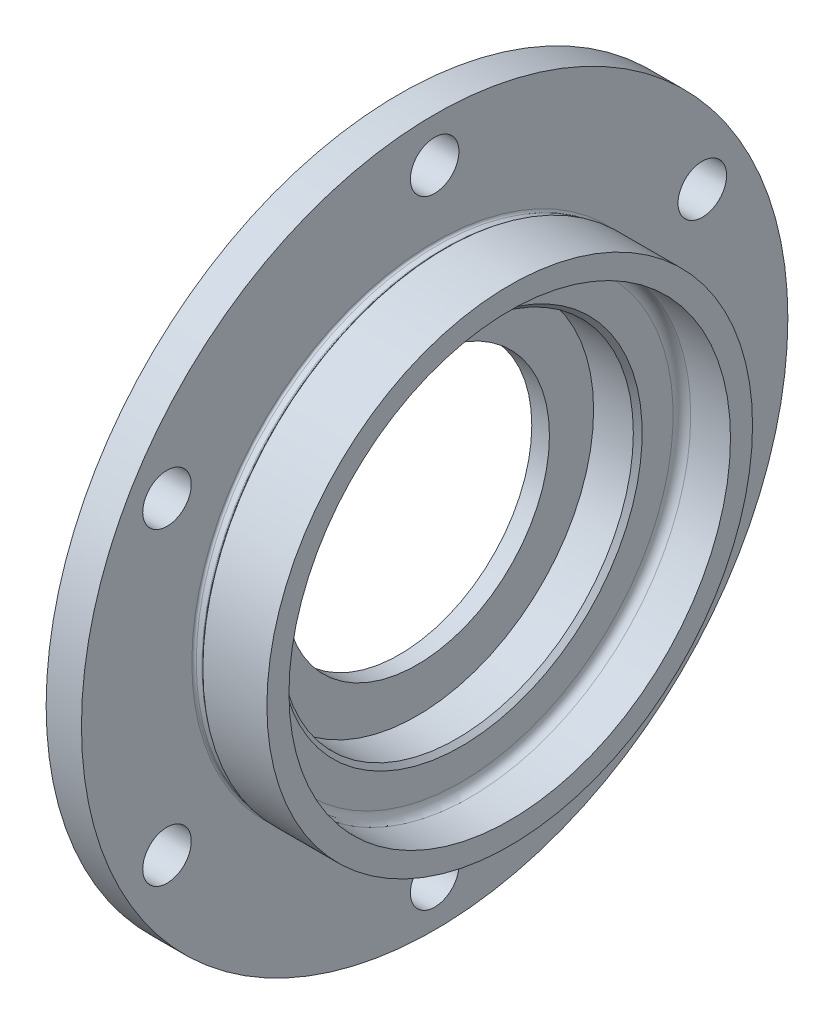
ISO-10303-21;
HEADER;
FILE_DESCRIPTION(('STEP AP214'),'2;1');
FILE_NAME('part.step','',(''),(''),'','','');
FILE_SCHEMA(('AUTOMOTIVE_DESIGN { 1 0 10303 214 1 1 1 1 }'));
ENDSEC;
DATA;
#1=APPLICATION_CONTEXT('core data for automotive mechanical design processes');
#2=APPLICATION_PROTOCOL_DEFINITION('international standard','automotive_design',2000,#1);
#3=PRODUCT_CONTEXT('',#1,'mechanical');
#4=PRODUCT('Part','Part','',(#3));
#5=PRODUCT_RELATED_PRODUCT_CATEGORY('part','',(#4));
#6=PRODUCT_DEFINITION_FORMATION('','',#4);
#7=PRODUCT_DEFINITION_CONTEXT('part definition',#1,'design');
#8=PRODUCT_DEFINITION('design','',#6,#7);
#9=PRODUCT_DEFINITION_SHAPE('','',#8);
#10=(LENGTH_UNIT() NAMED_UNIT(*) SI_UNIT(.MILLI.,.METRE.));
#11=(NAMED_UNIT(*) PLANE_ANGLE_UNIT() SI_UNIT($,.RADIAN.));
#12=(NAMED_UNIT(*) SI_UNIT($,.STERADIAN.) SOLID_ANGLE_UNIT());
#13=UNCERTAINTY_MEASURE_WITH_UNIT(LENGTH_MEASURE(1.E-05),#10,'distance_accuracy_value','');
#14=(GEOMETRIC_REPRESENTATION_CONTEXT(3) GLOBAL_UNCERTAINTY_ASSIGNED_CONTEXT((#13)) GLOBAL_UNIT_ASSIGNED_CONTEXT((#10,
#11,#12)) REPRESENTATION_CONTEXT('',''));
#15=CARTESIAN_POINT('',(0.,0.,0.));
#16=DIRECTION('',(0.,0.,1.));
#17=DIRECTION('',(1.,0.,0.));
#18=AXIS2_PLACEMENT_3D('',#15,#16,#17);
#19=CARTESIAN_POINT('',(4.,-25.3344041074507,0.));
#20=DIRECTION('',(-1.,0.,0.));
#21=DIRECTION('',(0.,0.,1.));
#22=AXIS2_PLACEMENT_3D('',#19,#20,#21);
#23=PLANE('',#22);
#24=CARTESIAN_POINT('',(4.,0.,0.));
#25=DIRECTION('',(-1.,0.,0.));
#26=DIRECTION('',(0.,0.,1.));
#27=AXIS2_PLACEMENT_3D('',#24,#25,#26);
#28=CIRCLE('',#27,30.);
#29=CARTESIAN_POINT('',(4.,0.,30.));
#30=VERTEX_POINT('',#29);
#31=EDGE_CURVE('E116',#30,#30,#28,.F.);
#32=ORIENTED_EDGE('',*,*,#31,.F.);
#33=EDGE_LOOP('',(#32));
#34=FACE_BOUND('',#33,.T.);
#35=CARTESIAN_POINT('',(4.,0.,0.));
#36=DIRECTION('',(1.,0.,0.));
#37=DIRECTION('',(0.,0.,-1.));
#38=AXIS2_PLACEMENT_3D('',#35,#36,#37);
#39=CIRCLE('',#38,40.);
#40=CARTESIAN_POINT('',(4.,0.,-40.));
#41=VERTEX_POINT('',#40);
#42=EDGE_CURVE('E62',#41,#41,#39,.T.);
#43=ORIENTED_EDGE('',*,*,#42,.T.);
#44=EDGE_LOOP('',(#43));
#45=FACE_BOUND('',#44,.T.);
#46=ADVANCED_FACE('F30',(#34,#45),#23,.F.);
#47=CARTESIAN_POINT('',(29.9069920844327,0.,0.));
#48=DIRECTION('',(1.,0.,0.));
#49=DIRECTION('',(0.,0.,-1.));
#50=AXIS2_PLACEMENT_3D('',#47,#48,#49);
#51=CYLINDRICAL_SURFACE('',#50,40.);
#52=CARTESIAN_POINT('',(13.,0.,0.));
#53=DIRECTION('',(-1.,0.,0.));
#54=DIRECTION('',(0.,0.,1.));
#55=AXIS2_PLACEMENT_3D('',#52,#53,#54);
#56=CIRCLE('',#55,40.);
#57=CARTESIAN_POINT('',(13.,0.,40.));
#58=VERTEX_POINT('',#57);
#59=EDGE_CURVE('E45',#58,#58,#56,.F.);
#60=ORIENTED_EDGE('',*,*,#59,.T.);
#61=EDGE_LOOP('',(#60));
#62=FACE_BOUND('',#61,.T.);
#63=ORIENTED_EDGE('',*,*,#42,.F.);
#64=EDGE_LOOP('',(#63));
#65=FACE_BOUND('',#64,.T.);
#66=ADVANCED_FACE('F158',(#62,#65),#51,.F.);
#67=CARTESIAN_POINT('',(14.,-25.3344041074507,0.));
#68=DIRECTION('',(-1.,0.,0.));
#69=DIRECTION('',(0.,0.,1.));
#70=AXIS2_PLACEMENT_3D('',#67,#68,#69);
#71=PLANE('',#70);
#72=CARTESIAN_POINT('',(14.,0.,0.));
#73=DIRECTION('',(-1.,0.,0.));
#74=DIRECTION('',(0.,0.,1.));
#75=AXIS2_PLACEMENT_3D('',#72,#73,#74);
#76=CIRCLE('',#75,48.);
#77=CARTESIAN_POINT('',(14.,0.,48.));
#78=VERTEX_POINT('',#77);
#79=EDGE_CURVE('E37',#78,#78,#76,.F.);
#80=ORIENTED_EDGE('',*,*,#79,.T.);
#81=EDGE_LOOP('',(#80));
#82=FACE_BOUND('',#81,.T.);
#83=CARTESIAN_POINT('',(14.,0.,0.));
#84=DIRECTION('',(-1.,0.,0.));
#85=DIRECTION('',(0.,0.,1.));
#86=AXIS2_PLACEMENT_3D('',#83,#84,#85);
#87=CIRCLE('',#86,41.);
#88=CARTESIAN_POINT('',(14.,0.,41.));
#89=VERTEX_POINT('',#88);
#90=EDGE_CURVE('E41',#89,#89,#87,.T.);
#91=ORIENTED_EDGE('',*,*,#90,.T.);
#92=EDGE_LOOP('',(#91));
#93=FACE_BOUND('',#92,.T.);
#94=ADVANCED_FACE('F164',(#82,#93),#71,.F.);
#95=CARTESIAN_POINT('',(29.9069920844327,0.,0.));
#96=DIRECTION('',(1.,0.,0.));
#97=DIRECTION('',(0.,0.,-1.));
#98=AXIS2_PLACEMENT_3D('',#95,#96,#97);
#99=CYLINDRICAL_SURFACE('',#98,50.);
#100=CARTESIAN_POINT('',(16.,0.,0.));
#101=DIRECTION('',(-1.,0.,0.));
#102=DIRECTION('',(0.,0.,1.));
#103=AXIS2_PLACEMENT_3D('',#100,#101,#102);
#104=CIRCLE('',#103,50.);
#105=CARTESIAN_POINT('',(16.,0.,50.));
#106=VERTEX_POINT('',#105);
#107=EDGE_CURVE('E10',#106,#106,#104,.T.);
#108=ORIENTED_EDGE('',*,*,#107,.T.);
#109=EDGE_LOOP('',(#108));
#110=FACE_BOUND('',#109,.T.);
#111=CARTESIAN_POINT('',(25.,0.,0.));
#112=DIRECTION('',(1.,0.,0.));
#113=DIRECTION('',(0.,0.,-1.));
#114=AXIS2_PLACEMENT_3D('',#111,#112,#113);
#115=CIRCLE('',#114,50.);
#116=CARTESIAN_POINT('',(25.,0.,-50.));
#117=VERTEX_POINT('',#116);
#118=EDGE_CURVE('E65',#117,#117,#115,.T.);
#119=ORIENTED_EDGE('',*,*,#118,.T.);
#120=EDGE_LOOP('',(#119));
#121=FACE_BOUND('',#120,.T.);
#122=ADVANCED_FACE('F195',(#110,#121),#99,.F.);
#123=CARTESIAN_POINT('',(25.,-25.3344041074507,0.));
#124=DIRECTION('',(-1.,0.,0.));
#125=DIRECTION('',(0.,0.,1.));
#126=AXIS2_PLACEMENT_3D('',#123,#124,#125);
#127=PLANE('',#126);
#128=ORIENTED_EDGE('',*,*,#118,.F.);
#129=EDGE_LOOP('',(#128));
#130=FACE_BOUND('',#129,.T.);
#131=CARTESIAN_POINT('',(25.,0.,0.));
#132=DIRECTION('',(1.,0.,0.));
#133=DIRECTION('',(0.,0.,-1.));
#134=AXIS2_PLACEMENT_3D('',#131,#132,#133);
#135=CIRCLE('',#134,55.);
#136=CARTESIAN_POINT('',(25.,0.,-55.));
#137=VERTEX_POINT('',#136);
#138=EDGE_CURVE('E68',#137,#137,#135,.T.);
#139=ORIENTED_EDGE('',*,*,#138,.T.);
#140=EDGE_LOOP('',(#139));
#141=FACE_BOUND('',#140,.T.);
#142=ADVANCED_FACE('F199',(#130,#141),#127,.F.);
#143=CARTESIAN_POINT('',(29.9069920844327,0.,0.));
#144=DIRECTION('',(1.,0.,0.));
#145=DIRECTION('',(0.,0.,-1.));
#146=AXIS2_PLACEMENT_3D('',#143,#144,#145);
#147=CYLINDRICAL_SURFACE('',#146,55.);
#148=CARTESIAN_POINT('',(10.5,0.,0.));
#149=DIRECTION('',(1.,0.,0.));
#150=DIRECTION('',(0.,0.,-1.));
#151=AXIS2_PLACEMENT_3D('',#148,#149,#150);
#152=CIRCLE('',#151,55.);
#153=CARTESIAN_POINT('',(10.5,0.,-55.));
#154=VERTEX_POINT('',#153);
#155=EDGE_CURVE('E77',#154,#154,#152,.T.);
#156=ORIENTED_EDGE('',*,*,#155,.T.);
#157=EDGE_LOOP('',(#156));
#158=FACE_BOUND('',#157,.T.);
#159=ORIENTED_EDGE('',*,*,#138,.F.);
#160=EDGE_LOOP('',(#159));
#161=FACE_BOUND('',#160,.T.);
#162=ADVANCED_FACE('F204',(#158,#161),#147,.T.);
#163=CARTESIAN_POINT('',(36.050630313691,0.,0.));
#164=DIRECTION('',(1.,0.,0.));
#165=DIRECTION('',(0.,0.,-1.));
#166=AXIS2_PLACEMENT_3D('',#163,#164,#165);
#167=CYLINDRICAL_SURFACE('',#166,54.5);
#168=CARTESIAN_POINT('',(8.5,0.,0.));
#169=DIRECTION('',(-1.,0.,0.));
#170=DIRECTION('',(0.,0.,1.));
#171=AXIS2_PLACEMENT_3D('',#168,#169,#170);
#172=CIRCLE('',#171,54.5);
#173=CARTESIAN_POINT('',(8.5,0.,54.5));
#174=VERTEX_POINT('',#173);
#175=EDGE_CURVE('E56',#174,#174,#172,.F.);
#176=ORIENTED_EDGE('',*,*,#175,.T.);
#177=EDGE_LOOP('',(#176));
#178=FACE_BOUND('',#177,.T.);
#179=CARTESIAN_POINT('',(9.79289321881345,0.,0.));
#180=DIRECTION('',(1.,0.,0.));
#181=DIRECTION('',(0.,0.,-1.));
#182=AXIS2_PLACEMENT_3D('',#179,#180,#181);
#183=CIRCLE('',#182,54.5);
#184=CARTESIAN_POINT('',(9.79289321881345,0.,-54.5));
#185=VERTEX_POINT('',#184);
#186=EDGE_CURVE('E59',#185,#185,#183,.F.);
#187=ORIENTED_EDGE('',*,*,#186,.T.);
#188=EDGE_LOOP('',(#187));
#189=FACE_BOUND('',#188,.T.);
#190=ADVANCED_FACE('F207',(#178,#189),#167,.T.);
#191=CARTESIAN_POINT('',(10.,0.,0.));
#192=DIRECTION('',(1.,0.,0.));
#193=DIRECTION('',(0.,0.,-1.));
#194=AXIS2_PLACEMENT_3D('',#191,#192,#193);
#195=CONICAL_SURFACE('',#194,54.5,0.785398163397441);
#196=CARTESIAN_POINT('',(10.1464466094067,0.,0.));
#197=DIRECTION('',(1.,0.,0.));
#198=DIRECTION('',(0.,0.,-1.));
#199=AXIS2_PLACEMENT_3D('',#196,#197,#198);
#200=CIRCLE('',#199,54.6464466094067);
#201=CARTESIAN_POINT('',(10.1464466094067,0.,-54.6464466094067));
#202=VERTEX_POINT('',#201);
#203=EDGE_CURVE('E50',#202,#202,#200,.T.);
#204=ORIENTED_EDGE('',*,*,#203,.T.);
#205=EDGE_LOOP('',(#204));
#206=FACE_BOUND('',#205,.T.);
#207=ORIENTED_EDGE('',*,*,#155,.F.);
#208=EDGE_LOOP('',(#207));
#209=FACE_BOUND('',#208,.T.);
#210=ADVANCED_FACE('F130',(#206,#209),#195,.T.);
#211=CARTESIAN_POINT('',(0.,-25.3344041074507,0.));
#212=DIRECTION('',(1.,0.,0.));
#213=DIRECTION('',(0.,0.,-1.));
#214=AXIS2_PLACEMENT_3D('',#211,#212,#213);
#215=PLANE('',#214);
#216=CARTESIAN_POINT('',(0.,0.,0.));
#217=DIRECTION('',(-1.,0.,0.));
#218=DIRECTION('',(0.,0.,1.));
#219=AXIS2_PLACEMENT_3D('',#216,#217,#218);
#220=CIRCLE('',#219,30.);
#221=CARTESIAN_POINT('',(0.,0.,30.));
#222=VERTEX_POINT('',#221);
#223=EDGE_CURVE('E119',#222,#222,#220,.T.);
#224=ORIENTED_EDGE('',*,*,#223,.F.);
#225=EDGE_LOOP('',(#224));
#226=FACE_BOUND('',#225,.T.);
#227=CARTESIAN_POINT('',(0.,35.0000000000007,-60.6217782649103));
#228=DIRECTION('',(-1.,0.,0.));
#229=DIRECTION('',(0.,0.866025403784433,0.50000000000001));
#230=AXIS2_PLACEMENT_3D('',#227,#228,#229);
#231=CIRCLE('',#230,5.5);
#232=CARTESIAN_POINT('',(0.,35.0000000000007,-55.1217782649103));
#233=VERTEX_POINT('',#232);
#234=EDGE_CURVE('E113',#233,#233,#231,.T.);
#235=ORIENTED_EDGE('',*,*,#234,.F.);
#236=EDGE_LOOP('',(#235));
#237=FACE_BOUND('',#236,.T.);
#238=CARTESIAN_POINT('',(0.,-34.9999999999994,-60.621778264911));
#239=DIRECTION('',(-1.,0.,0.));
#240=DIRECTION('',(0.,0.866025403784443,-0.499999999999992));
#241=AXIS2_PLACEMENT_3D('',#238,#239,#240);
#242=CIRCLE('',#241,5.5);
#243=CARTESIAN_POINT('',(0.,-34.9999999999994,-55.121778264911));
#244=VERTEX_POINT('',#243);
#245=EDGE_CURVE('E107',#244,#244,#242,.T.);
#246=ORIENTED_EDGE('',*,*,#245,.F.);
#247=EDGE_LOOP('',(#246));
#248=FACE_BOUND('',#247,.T.);
#249=CARTESIAN_POINT('',(0.,-70.,-4.88807670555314E-13));
#250=DIRECTION('',(-1.,0.,0.));
#251=DIRECTION('',(0.,0.,-1.));
#252=AXIS2_PLACEMENT_3D('',#249,#250,#251);
#253=CIRCLE('',#252,5.5);
#254=CARTESIAN_POINT('',(0.,-70.,5.49999999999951));
#255=VERTEX_POINT('',#254);
#256=EDGE_CURVE('E101',#255,#255,#253,.T.);
#257=ORIENTED_EDGE('',*,*,#256,.F.);
#258=EDGE_LOOP('',(#257));
#259=FACE_BOUND('',#258,.T.);
#260=CARTESIAN_POINT('',(0.,-35.0000000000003,60.6217782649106));
#261=DIRECTION('',(-1.,0.,0.));
#262=DIRECTION('',(0.,-0.866025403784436,-0.500000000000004));
#263=AXIS2_PLACEMENT_3D('',#260,#261,#262);
#264=CIRCLE('',#263,5.5);
#265=CARTESIAN_POINT('',(0.,-35.0000000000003,66.1217782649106));
#266=VERTEX_POINT('',#265);
#267=EDGE_CURVE('E95',#266,#266,#264,.T.);
#268=ORIENTED_EDGE('',*,*,#267,.F.);
#269=EDGE_LOOP('',(#268));
#270=FACE_BOUND('',#269,.T.);
#271=CARTESIAN_POINT('',(0.,34.9999999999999,60.6217782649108));
#272=DIRECTION('',(-1.,0.,0.));
#273=DIRECTION('',(0.,-0.86602540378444,0.499999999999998));
#274=AXIS2_PLACEMENT_3D('',#271,#272,#273);
#275=CIRCLE('',#274,5.5);
#276=CARTESIAN_POINT('',(0.,34.9999999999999,66.1217782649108));
#277=VERTEX_POINT('',#276);
#278=EDGE_CURVE('E89',#277,#277,#275,.T.);
#279=ORIENTED_EDGE('',*,*,#278,.F.);
#280=EDGE_LOOP('',(#279));
#281=FACE_BOUND('',#280,.T.);
#282=CARTESIAN_POINT('',(0.,70.,0.));
#283=DIRECTION('',(-1.,0.,0.));
#284=DIRECTION('',(0.,0.,1.));
#285=AXIS2_PLACEMENT_3D('',#282,#283,#284);
#286=CIRCLE('',#285,5.5);
#287=CARTESIAN_POINT('',(0.,70.,5.5));
#288=VERTEX_POINT('',#287);
#289=EDGE_CURVE('E83',#288,#288,#286,.T.);
#290=ORIENTED_EDGE('',*,*,#289,.F.);
#291=EDGE_LOOP('',(#290));
#292=FACE_BOUND('',#291,.T.);
#293=CARTESIAN_POINT('',(0.,0.,0.));
#294=DIRECTION('',(1.,0.,0.));
#295=DIRECTION('',(0.,0.,-1.));
#296=AXIS2_PLACEMENT_3D('',#293,#294,#295);
#297=CIRCLE('',#296,80.);
#298=CARTESIAN_POINT('',(0.,0.,-80.));
#299=VERTEX_POINT('',#298);
#300=EDGE_CURVE('E74',#299,#299,#297,.T.);
#301=ORIENTED_EDGE('',*,*,#300,.F.);
#302=EDGE_LOOP('',(#301));
#303=FACE_BOUND('',#302,.T.);
#304=ADVANCED_FACE('F126',(#226,#237,#248,#259,#270,#281,#292,#303),#215,.F.);
#305=CARTESIAN_POINT('',(29.9069920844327,0.,0.));
#306=DIRECTION('',(1.,0.,0.));
#307=DIRECTION('',(0.,0.,-1.));
#308=AXIS2_PLACEMENT_3D('',#305,#306,#307);
#309=CYLINDRICAL_SURFACE('',#308,80.);
#310=CARTESIAN_POINT('',(8.,0.,0.));
#311=DIRECTION('',(1.,0.,0.));
#312=DIRECTION('',(0.,0.,-1.));
#313=AXIS2_PLACEMENT_3D('',#310,#311,#312);
#314=CIRCLE('',#313,80.);
#315=CARTESIAN_POINT('',(8.,0.,-80.));
#316=VERTEX_POINT('',#315);
#317=EDGE_CURVE('E71',#316,#316,#314,.T.);
#318=ORIENTED_EDGE('',*,*,#317,.F.);
#319=EDGE_LOOP('',(#318));
#320=FACE_BOUND('',#319,.T.);
#321=ORIENTED_EDGE('',*,*,#300,.T.);
#322=EDGE_LOOP('',(#321));
#323=FACE_BOUND('',#322,.T.);
#324=ADVANCED_FACE('F129',(#320,#323),#309,.T.);
#325=CARTESIAN_POINT('',(8.,-25.3344041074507,0.));
#326=DIRECTION('',(-1.,0.,0.));
#327=DIRECTION('',(0.,0.,1.));
#328=AXIS2_PLACEMENT_3D('',#325,#326,#327);
#329=PLANE('',#328);
#330=CARTESIAN_POINT('',(8.,35.0000000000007,-60.6217782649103));
#331=DIRECTION('',(-1.,0.,0.));
#332=DIRECTION('',(0.,0.,1.));
#333=AXIS2_PLACEMENT_3D('',#330,#331,#332);
#334=CIRCLE('',#333,5.5);
#335=CARTESIAN_POINT('',(8.,35.0000000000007,-55.1217782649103));
#336=VERTEX_POINT('',#335);
#337=EDGE_CURVE('E110',#336,#336,#334,.F.);
#338=ORIENTED_EDGE('',*,*,#337,.F.);
#339=EDGE_LOOP('',(#338));
#340=FACE_BOUND('',#339,.T.);
#341=CARTESIAN_POINT('',(8.,-34.9999999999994,-60.621778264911));
#342=DIRECTION('',(-1.,0.,0.));
#343=DIRECTION('',(0.,0.,1.));
#344=AXIS2_PLACEMENT_3D('',#341,#342,#343);
#345=CIRCLE('',#344,5.5);
#346=CARTESIAN_POINT('',(8.,-34.9999999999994,-55.121778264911));
#347=VERTEX_POINT('',#346);
#348=EDGE_CURVE('E104',#347,#347,#345,.F.);
#349=ORIENTED_EDGE('',*,*,#348,.F.);
#350=EDGE_LOOP('',(#349));
#351=FACE_BOUND('',#350,.T.);
#352=CARTESIAN_POINT('',(8.,-70.,-4.88807670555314E-13));
#353=DIRECTION('',(-1.,0.,0.));
#354=DIRECTION('',(0.,0.,1.));
#355=AXIS2_PLACEMENT_3D('',#352,#353,#354);
#356=CIRCLE('',#355,5.5);
#357=CARTESIAN_POINT('',(8.,-70.,5.49999999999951));
#358=VERTEX_POINT('',#357);
#359=EDGE_CURVE('E98',#358,#358,#356,.F.);
#360=ORIENTED_EDGE('',*,*,#359,.F.);
#361=EDGE_LOOP('',(#360));
#362=FACE_BOUND('',#361,.T.);
#363=CARTESIAN_POINT('',(8.,-35.0000000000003,60.6217782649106));
#364=DIRECTION('',(-1.,0.,0.));
#365=DIRECTION('',(0.,0.,1.));
#366=AXIS2_PLACEMENT_3D('',#363,#364,#365);
#367=CIRCLE('',#366,5.5);
#368=CARTESIAN_POINT('',(8.,-35.0000000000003,66.1217782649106));
#369=VERTEX_POINT('',#368);
#370=EDGE_CURVE('E92',#369,#369,#367,.F.);
#371=ORIENTED_EDGE('',*,*,#370,.F.);
#372=EDGE_LOOP('',(#371));
#373=FACE_BOUND('',#372,.T.);
#374=CARTESIAN_POINT('',(8.,34.9999999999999,60.6217782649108));
#375=DIRECTION('',(-1.,0.,0.));
#376=DIRECTION('',(0.,0.,1.));
#377=AXIS2_PLACEMENT_3D('',#374,#375,#376);
#378=CIRCLE('',#377,5.5);
#379=CARTESIAN_POINT('',(8.,34.9999999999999,66.1217782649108));
#380=VERTEX_POINT('',#379);
#381=EDGE_CURVE('E86',#380,#380,#378,.F.);
#382=ORIENTED_EDGE('',*,*,#381,.F.);
#383=EDGE_LOOP('',(#382));
#384=FACE_BOUND('',#383,.T.);
#385=CARTESIAN_POINT('',(8.,70.,0.));
#386=DIRECTION('',(-1.,0.,0.));
#387=DIRECTION('',(0.,0.,1.));
#388=AXIS2_PLACEMENT_3D('',#385,#386,#387);
#389=CIRCLE('',#388,5.5);
#390=CARTESIAN_POINT('',(8.,70.,5.5));
#391=VERTEX_POINT('',#390);
#392=EDGE_CURVE('E80',#391,#391,#389,.F.);
#393=ORIENTED_EDGE('',*,*,#392,.F.);
#394=EDGE_LOOP('',(#393));
#395=FACE_BOUND('',#394,.T.);
#396=CARTESIAN_POINT('',(8.,0.,0.));
#397=DIRECTION('',(-1.,0.,0.));
#398=DIRECTION('',(0.,0.,1.));
#399=AXIS2_PLACEMENT_3D('',#396,#397,#398);
#400=CIRCLE('',#399,55.);
#401=CARTESIAN_POINT('',(8.,0.,55.));
#402=VERTEX_POINT('',#401);
#403=EDGE_CURVE('E53',#402,#402,#400,.T.);
#404=ORIENTED_EDGE('',*,*,#403,.T.);
#405=EDGE_LOOP('',(#404));
#406=FACE_BOUND('',#405,.T.);
#407=ORIENTED_EDGE('',*,*,#317,.T.);
#408=EDGE_LOOP('',(#407));
#409=FACE_BOUND('',#408,.T.);
#410=ADVANCED_FACE('F147',(#340,#351,#362,#373,#384,#395,#406,#409),#329,.F.);
#411=CARTESIAN_POINT('',(8.5,0.,0.));
#412=DIRECTION('',(-1.,0.,0.));
#413=DIRECTION('',(0.,0.,1.));
#414=AXIS2_PLACEMENT_3D('',#411,#412,#413);
#415=TOROIDAL_SURFACE('',#414,55.,0.5);
#416=ORIENTED_EDGE('',*,*,#403,.F.);
#417=EDGE_LOOP('',(#416));
#418=FACE_BOUND('',#417,.T.);
#419=ORIENTED_EDGE('',*,*,#175,.F.);
#420=EDGE_LOOP('',(#419));
#421=FACE_BOUND('',#420,.T.);
#422=ADVANCED_FACE('F153',(#418,#421),#415,.F.);
#423=CARTESIAN_POINT('',(9.79289321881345,0.,0.));
#424=DIRECTION('',(1.,0.,0.));
#425=DIRECTION('',(0.,0.,-1.));
#426=AXIS2_PLACEMENT_3D('',#423,#424,#425);
#427=TOROIDAL_SURFACE('',#426,55.,0.5);
#428=ORIENTED_EDGE('',*,*,#186,.F.);
#429=EDGE_LOOP('',(#428));
#430=FACE_BOUND('',#429,.T.);
#431=ORIENTED_EDGE('',*,*,#203,.F.);
#432=EDGE_LOOP('',(#431));
#433=FACE_BOUND('',#432,.T.);
#434=ADVANCED_FACE('F173',(#430,#433),#427,.F.);
#435=CARTESIAN_POINT('',(25.001,70.,0.));
#436=DIRECTION('',(-1.,0.,0.));
#437=DIRECTION('',(0.,0.,1.));
#438=AXIS2_PLACEMENT_3D('',#435,#436,#437);
#439=CYLINDRICAL_SURFACE('',#438,5.5);
#440=CARTESIAN_POINT('',(0.,70.,5.5));
#441=CARTESIAN_POINT('',(0.0833333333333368,70.,5.5));
#442=CARTESIAN_POINT('',(0.16666666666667,70.,5.5));
#443=CARTESIAN_POINT('',(0.333333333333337,70.,5.5));
#444=CARTESIAN_POINT('',(0.416666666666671,70.,5.5));
#445=CARTESIAN_POINT('',(0.583333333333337,70.,5.5));
#446=CARTESIAN_POINT('',(0.666666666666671,70.,5.5));
#447=CARTESIAN_POINT('',(0.833333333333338,70.,5.5));
#448=CARTESIAN_POINT('',(0.916666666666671,70.,5.5));
#449=CARTESIAN_POINT('',(1.08333333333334,70.,5.5));
#450=CARTESIAN_POINT('',(1.16666666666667,70.,5.5));
#451=CARTESIAN_POINT('',(1.33333333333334,70.,5.5));
#452=CARTESIAN_POINT('',(1.41666666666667,70.,5.5));
#453=CARTESIAN_POINT('',(1.58333333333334,70.,5.5));
#454=CARTESIAN_POINT('',(1.66666666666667,70.,5.5));
#455=CARTESIAN_POINT('',(1.83333333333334,70.,5.5));
#456=CARTESIAN_POINT('',(1.91666666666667,70.,5.5));
#457=CARTESIAN_POINT('',(2.08333333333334,70.,5.5));
#458=CARTESIAN_POINT('',(2.16666666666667,70.,5.5));
#459=CARTESIAN_POINT('',(2.33333333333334,70.,5.5));
#460=CARTESIAN_POINT('',(2.41666666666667,70.,5.5));
#461=CARTESIAN_POINT('',(2.58333333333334,70.,5.5));
#462=CARTESIAN_POINT('',(2.66666666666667,70.,5.5));
#463=CARTESIAN_POINT('',(2.83333333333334,70.,5.5));
#464=CARTESIAN_POINT('',(2.91666666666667,70.,5.5));
#465=CARTESIAN_POINT('',(3.08333333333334,70.,5.5));
#466=CARTESIAN_POINT('',(3.16666666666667,70.,5.5));
#467=CARTESIAN_POINT('',(3.33333333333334,70.,5.5));
#468=CARTESIAN_POINT('',(3.41666666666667,70.,5.5));
#469=CARTESIAN_POINT('',(3.58333333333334,70.,5.5));
#470=CARTESIAN_POINT('',(3.66666666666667,70.,5.5));
#471=CARTESIAN_POINT('',(3.83333333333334,70.,5.5));
#472=CARTESIAN_POINT('',(3.91666666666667,70.,5.5));
#473=CARTESIAN_POINT('',(4.08333333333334,70.,5.5));
#474=CARTESIAN_POINT('',(4.16666666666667,70.,5.5));
#475=CARTESIAN_POINT('',(4.33333333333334,70.,5.5));
#476=CARTESIAN_POINT('',(4.41666666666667,70.,5.5));
#477=CARTESIAN_POINT('',(4.58333333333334,70.,5.5));
#478=CARTESIAN_POINT('',(4.66666666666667,70.,5.5));
#479=CARTESIAN_POINT('',(4.83333333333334,70.,5.5));
#480=CARTESIAN_POINT('',(4.91666666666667,70.,5.5));
#481=CARTESIAN_POINT('',(5.08333333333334,70.,5.5));
#482=CARTESIAN_POINT('',(5.16666666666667,70.,5.5));
#483=CARTESIAN_POINT('',(5.33333333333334,70.,5.5));
#484=CARTESIAN_POINT('',(5.41666666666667,70.,5.5));
#485=CARTESIAN_POINT('',(5.58333333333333,70.,5.5));
#486=CARTESIAN_POINT('',(5.66666666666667,70.,5.5));
#487=CARTESIAN_POINT('',(5.83333333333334,70.,5.5));
#488=CARTESIAN_POINT('',(5.91666666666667,70.,5.5));
#489=CARTESIAN_POINT('',(6.08333333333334,70.,5.5));
#490=CARTESIAN_POINT('',(6.16666666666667,70.,5.5));
#491=CARTESIAN_POINT('',(6.33333333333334,70.,5.5));
#492=CARTESIAN_POINT('',(6.41666666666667,70.,5.5));
#493=CARTESIAN_POINT('',(6.58333333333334,70.,5.5));
#494=CARTESIAN_POINT('',(6.66666666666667,70.,5.5));
#495=CARTESIAN_POINT('',(6.83333333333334,70.,5.5));
#496=CARTESIAN_POINT('',(6.91666666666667,70.,5.5));
#497=CARTESIAN_POINT('',(7.08333333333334,70.,5.5));
#498=CARTESIAN_POINT('',(7.16666666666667,70.,5.5));
#499=CARTESIAN_POINT('',(7.33333333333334,70.,5.5));
#500=CARTESIAN_POINT('',(7.41666666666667,70.,5.5));
#501=CARTESIAN_POINT('',(7.58333333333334,70.,5.5));
#502=CARTESIAN_POINT('',(7.66666666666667,70.,5.5));
#503=CARTESIAN_POINT('',(7.83333333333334,70.,5.5));
#504=CARTESIAN_POINT('',(7.91666666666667,70.,5.5));
#505=CARTESIAN_POINT('',(8.,70.,5.5));
#506=B_SPLINE_CURVE_WITH_KNOTS('',3,(#440,#441,#442,#443,#444,#445,#446,#447,#448,#449,#450,
#451,#452,#453,#454,#455,#456,#457,#458,#459,#460,#461,#462,#463,#464,#465,#466,#467,#468,#469,
#470,#471,#472,#473,#474,#475,#476,#477,#478,#479,#480,#481,#482,#483,#484,#485,#486,#487,#488,
#489,#490,#491,#492,#493,#494,#495,#496,#497,#498,#499,#500,#501,#502,#503,#504,#505),
.UNSPECIFIED.,.F.,.F.,(4,2,2,2,2,2,2,2,2,2,2,2,2,2,2,2,2,2,2,2,2,2,2,2,2,2,2,2,2,2,2,2,4),(0.,
0.25,0.5,0.750000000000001,1.,1.25,1.5,1.75,2.,2.25,2.5,2.75,3.,3.25,3.5,3.75,4.,4.25,4.5,4.75,
5.,5.25,5.5,5.75,6.,6.25,6.5,6.75,7.,7.25,7.5,7.75,8.),.UNSPECIFIED.);
#507=EDGE_CURVE('BSEAM176',#288,#391,#506,.T.);
#508=ORIENTED_EDGE('',*,*,#289,.T.);
#509=ORIENTED_EDGE('',*,*,#392,.T.);
#510=ORIENTED_EDGE('',*,*,#507,.T.);
#511=ORIENTED_EDGE('',*,*,#507,.F.);
#512=EDGE_LOOP('',(#508,#510,#509,#511));
#513=FACE_BOUND('',#512,.T.);
#514=ADVANCED_FACE('F176',(#513),#439,.F.);
#515=CARTESIAN_POINT('',(25.001,34.9999999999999,60.6217782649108));
#516=DIRECTION('',(-1.,0.,0.));
#517=DIRECTION('',(0.,0.,1.));
#518=AXIS2_PLACEMENT_3D('',#515,#516,#517);
#519=CYLINDRICAL_SURFACE('',#518,5.5);
#520=CARTESIAN_POINT('',(0.,34.9999999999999,66.1217782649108));
#521=CARTESIAN_POINT('',(0.0833333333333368,34.9999999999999,66.1217782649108));
#522=CARTESIAN_POINT('',(0.16666666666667,34.9999999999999,66.1217782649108));
#523=CARTESIAN_POINT('',(0.333333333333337,34.9999999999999,66.1217782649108));
#524=CARTESIAN_POINT('',(0.416666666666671,34.9999999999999,66.1217782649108));
#525=CARTESIAN_POINT('',(0.583333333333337,34.9999999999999,66.1217782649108));
#526=CARTESIAN_POINT('',(0.666666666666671,34.9999999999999,66.1217782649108));
#527=CARTESIAN_POINT('',(0.833333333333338,34.9999999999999,66.1217782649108));
#528=CARTESIAN_POINT('',(0.916666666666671,34.9999999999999,66.1217782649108));
#529=CARTESIAN_POINT('',(1.08333333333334,34.9999999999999,66.1217782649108));
#530=CARTESIAN_POINT('',(1.16666666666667,34.9999999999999,66.1217782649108));
#531=CARTESIAN_POINT('',(1.33333333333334,34.9999999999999,66.1217782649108));
#532=CARTESIAN_POINT('',(1.41666666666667,34.9999999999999,66.1217782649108));
#533=CARTESIAN_POINT('',(1.58333333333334,34.9999999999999,66.1217782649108));
#534=CARTESIAN_POINT('',(1.66666666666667,34.9999999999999,66.1217782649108));
#535=CARTESIAN_POINT('',(1.83333333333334,34.9999999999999,66.1217782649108));
#536=CARTESIAN_POINT('',(1.91666666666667,34.9999999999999,66.1217782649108));
#537=CARTESIAN_POINT('',(2.08333333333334,34.9999999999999,66.1217782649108));
#538=CARTESIAN_POINT('',(2.16666666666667,34.9999999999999,66.1217782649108));
#539=CARTESIAN_POINT('',(2.33333333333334,34.9999999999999,66.1217782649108));
#540=CARTESIAN_POINT('',(2.41666666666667,34.9999999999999,66.1217782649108));
#541=CARTESIAN_POINT('',(2.58333333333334,34.9999999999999,66.1217782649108));
#542=CARTESIAN_POINT('',(2.66666666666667,34.9999999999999,66.1217782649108));
#543=CARTESIAN_POINT('',(2.83333333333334,34.9999999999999,66.1217782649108));
#544=CARTESIAN_POINT('',(2.91666666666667,34.9999999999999,66.1217782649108));
#545=CARTESIAN_POINT('',(3.08333333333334,34.9999999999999,66.1217782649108));
#546=CARTESIAN_POINT('',(3.16666666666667,34.9999999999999,66.1217782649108));
#547=CARTESIAN_POINT('',(3.33333333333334,34.9999999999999,66.1217782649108));
#548=CARTESIAN_POINT('',(3.41666666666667,34.9999999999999,66.1217782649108));
#549=CARTESIAN_POINT('',(3.58333333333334,34.9999999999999,66.1217782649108));
#550=CARTESIAN_POINT('',(3.66666666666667,34.9999999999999,66.1217782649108));
#551=CARTESIAN_POINT('',(3.83333333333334,34.9999999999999,66.1217782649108));
#552=CARTESIAN_POINT('',(3.91666666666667,34.9999999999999,66.1217782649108));
#553=CARTESIAN_POINT('',(4.08333333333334,34.9999999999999,66.1217782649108));
#554=CARTESIAN_POINT('',(4.16666666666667,34.9999999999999,66.1217782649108));
#555=CARTESIAN_POINT('',(4.33333333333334,34.9999999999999,66.1217782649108));
#556=CARTESIAN_POINT('',(4.41666666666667,34.9999999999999,66.1217782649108));
#557=CARTESIAN_POINT('',(4.58333333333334,34.9999999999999,66.1217782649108));
#558=CARTESIAN_POINT('',(4.66666666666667,34.9999999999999,66.1217782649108));
#559=CARTESIAN_POINT('',(4.83333333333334,34.9999999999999,66.1217782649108));
#560=CARTESIAN_POINT('',(4.91666666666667,34.9999999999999,66.1217782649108));
#561=CARTESIAN_POINT('',(5.08333333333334,34.9999999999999,66.1217782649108));
#562=CARTESIAN_POINT('',(5.16666666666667,34.9999999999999,66.1217782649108));
#563=CARTESIAN_POINT('',(5.33333333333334,34.9999999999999,66.1217782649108));
#564=CARTESIAN_POINT('',(5.41666666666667,34.9999999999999,66.1217782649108));
#565=CARTESIAN_POINT('',(5.58333333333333,34.9999999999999,66.1217782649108));
#566=CARTESIAN_POINT('',(5.66666666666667,34.9999999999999,66.1217782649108));
#567=CARTESIAN_POINT('',(5.83333333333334,34.9999999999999,66.1217782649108));
#568=CARTESIAN_POINT('',(5.91666666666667,34.9999999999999,66.1217782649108));
#569=CARTESIAN_POINT('',(6.08333333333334,34.9999999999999,66.1217782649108));
#570=CARTESIAN_POINT('',(6.16666666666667,34.9999999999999,66.1217782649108));
#571=CARTESIAN_POINT('',(6.33333333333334,34.9999999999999,66.1217782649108));
#572=CARTESIAN_POINT('',(6.41666666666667,34.9999999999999,66.1217782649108));
#573=CARTESIAN_POINT('',(6.58333333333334,34.9999999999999,66.1217782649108));
#574=CARTESIAN_POINT('',(6.66666666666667,34.9999999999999,66.1217782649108));
#575=CARTESIAN_POINT('',(6.83333333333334,34.9999999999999,66.1217782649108));
#576=CARTESIAN_POINT('',(6.91666666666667,34.9999999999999,66.1217782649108));
#577=CARTESIAN_POINT('',(7.08333333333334,34.9999999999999,66.1217782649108));
#578=CARTESIAN_POINT('',(7.16666666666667,34.9999999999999,66.1217782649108));
#579=CARTESIAN_POINT('',(7.33333333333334,34.9999999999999,66.1217782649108));
#580=CARTESIAN_POINT('',(7.41666666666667,34.9999999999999,66.1217782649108));
#581=CARTESIAN_POINT('',(7.58333333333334,34.9999999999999,66.1217782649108));
#582=CARTESIAN_POINT('',(7.66666666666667,34.9999999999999,66.1217782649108));
#583=CARTESIAN_POINT('',(7.83333333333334,34.9999999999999,66.1217782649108));
#584=CARTESIAN_POINT('',(7.91666666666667,34.9999999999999,66.1217782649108));
#585=CARTESIAN_POINT('',(8.,34.9999999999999,66.1217782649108));
#586=B_SPLINE_CURVE_WITH_KNOTS('',3,(#520,#521,#522,#523,#524,#525,#526,#527,#528,#529,#530,
#531,#532,#533,#534,#535,#536,#537,#538,#539,#540,#541,#542,#543,#544,#545,#546,#547,#548,#549,
#550,#551,#552,#553,#554,#555,#556,#557,#558,#559,#560,#561,#562,#563,#564,#565,#566,#567,#568,
#569,#570,#571,#572,#573,#574,#575,#576,#577,#578,#579,#580,#581,#582,#583,#584,#585),
.UNSPECIFIED.,.F.,.F.,(4,2,2,2,2,2,2,2,2,2,2,2,2,2,2,2,2,2,2,2,2,2,2,2,2,2,2,2,2,2,2,2,4),(0.,
0.25,0.5,0.750000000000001,1.,1.25,1.5,1.75,2.,2.25,2.5,2.75,3.,3.25,3.5,3.75,4.,4.25,4.5,4.75,
5.,5.25,5.5,5.75,6.,6.25,6.5,6.75,7.,7.25,7.5,7.75,8.),.UNSPECIFIED.);
#587=EDGE_CURVE('BSEAM227',#277,#380,#586,.T.);
#588=ORIENTED_EDGE('',*,*,#278,.T.);
#589=ORIENTED_EDGE('',*,*,#381,.T.);
#590=ORIENTED_EDGE('',*,*,#587,.T.);
#591=ORIENTED_EDGE('',*,*,#587,.F.);
#592=EDGE_LOOP('',(#588,#590,#589,#591));
#593=FACE_BOUND('',#592,.T.);
#594=ADVANCED_FACE('F227',(#593),#519,.F.);
#595=CARTESIAN_POINT('',(25.001,-35.0000000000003,60.6217782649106));
#596=DIRECTION('',(-1.,0.,0.));
#597=DIRECTION('',(0.,0.,1.));
#598=AXIS2_PLACEMENT_3D('',#595,#596,#597);
#599=CYLINDRICAL_SURFACE('',#598,5.5);
#600=CARTESIAN_POINT('',(0.,-35.0000000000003,66.1217782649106));
#601=CARTESIAN_POINT('',(0.0833333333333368,-35.0000000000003,66.1217782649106));
#602=CARTESIAN_POINT('',(0.16666666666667,-35.0000000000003,66.1217782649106));
#603=CARTESIAN_POINT('',(0.333333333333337,-35.0000000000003,66.1217782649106));
#604=CARTESIAN_POINT('',(0.416666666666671,-35.0000000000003,66.1217782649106));
#605=CARTESIAN_POINT('',(0.583333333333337,-35.0000000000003,66.1217782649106));
#606=CARTESIAN_POINT('',(0.666666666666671,-35.0000000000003,66.1217782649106));
#607=CARTESIAN_POINT('',(0.833333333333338,-35.0000000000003,66.1217782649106));
#608=CARTESIAN_POINT('',(0.916666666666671,-35.0000000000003,66.1217782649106));
#609=CARTESIAN_POINT('',(1.08333333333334,-35.0000000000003,66.1217782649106));
#610=CARTESIAN_POINT('',(1.16666666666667,-35.0000000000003,66.1217782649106));
#611=CARTESIAN_POINT('',(1.33333333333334,-35.0000000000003,66.1217782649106));
#612=CARTESIAN_POINT('',(1.41666666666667,-35.0000000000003,66.1217782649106));
#613=CARTESIAN_POINT('',(1.58333333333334,-35.0000000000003,66.1217782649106));
#614=CARTESIAN_POINT('',(1.66666666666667,-35.0000000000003,66.1217782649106));
#615=CARTESIAN_POINT('',(1.83333333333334,-35.0000000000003,66.1217782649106));
#616=CARTESIAN_POINT('',(1.91666666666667,-35.0000000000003,66.1217782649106));
#617=CARTESIAN_POINT('',(2.08333333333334,-35.0000000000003,66.1217782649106));
#618=CARTESIAN_POINT('',(2.16666666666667,-35.0000000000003,66.1217782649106));
#619=CARTESIAN_POINT('',(2.33333333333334,-35.0000000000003,66.1217782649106));
#620=CARTESIAN_POINT('',(2.41666666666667,-35.0000000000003,66.1217782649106));
#621=CARTESIAN_POINT('',(2.58333333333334,-35.0000000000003,66.1217782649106));
#622=CARTESIAN_POINT('',(2.66666666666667,-35.0000000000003,66.1217782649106));
#623=CARTESIAN_POINT('',(2.83333333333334,-35.0000000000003,66.1217782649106));
#624=CARTESIAN_POINT('',(2.91666666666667,-35.0000000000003,66.1217782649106));
#625=CARTESIAN_POINT('',(3.08333333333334,-35.0000000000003,66.1217782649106));
#626=CARTESIAN_POINT('',(3.16666666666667,-35.0000000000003,66.1217782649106));
#627=CARTESIAN_POINT('',(3.33333333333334,-35.0000000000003,66.1217782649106));
#628=CARTESIAN_POINT('',(3.41666666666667,-35.0000000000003,66.1217782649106));
#629=CARTESIAN_POINT('',(3.58333333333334,-35.0000000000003,66.1217782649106));
#630=CARTESIAN_POINT('',(3.66666666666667,-35.0000000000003,66.1217782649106));
#631=CARTESIAN_POINT('',(3.83333333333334,-35.0000000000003,66.1217782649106));
#632=CARTESIAN_POINT('',(3.91666666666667,-35.0000000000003,66.1217782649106));
#633=CARTESIAN_POINT('',(4.08333333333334,-35.0000000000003,66.1217782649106));
#634=CARTESIAN_POINT('',(4.16666666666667,-35.0000000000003,66.1217782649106));
#635=CARTESIAN_POINT('',(4.33333333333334,-35.0000000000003,66.1217782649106));
#636=CARTESIAN_POINT('',(4.41666666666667,-35.0000000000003,66.1217782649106));
#637=CARTESIAN_POINT('',(4.58333333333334,-35.0000000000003,66.1217782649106));
#638=CARTESIAN_POINT('',(4.66666666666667,-35.0000000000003,66.1217782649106));
#639=CARTESIAN_POINT('',(4.83333333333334,-35.0000000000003,66.1217782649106));
#640=CARTESIAN_POINT('',(4.91666666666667,-35.0000000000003,66.1217782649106));
#641=CARTESIAN_POINT('',(5.08333333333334,-35.0000000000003,66.1217782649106));
#642=CARTESIAN_POINT('',(5.16666666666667,-35.0000000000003,66.1217782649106));
#643=CARTESIAN_POINT('',(5.33333333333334,-35.0000000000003,66.1217782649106));
#644=CARTESIAN_POINT('',(5.41666666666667,-35.0000000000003,66.1217782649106));
#645=CARTESIAN_POINT('',(5.58333333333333,-35.0000000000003,66.1217782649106));
#646=CARTESIAN_POINT('',(5.66666666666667,-35.0000000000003,66.1217782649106));
#647=CARTESIAN_POINT('',(5.83333333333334,-35.0000000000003,66.1217782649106));
#648=CARTESIAN_POINT('',(5.91666666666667,-35.0000000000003,66.1217782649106));
#649=CARTESIAN_POINT('',(6.08333333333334,-35.0000000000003,66.1217782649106));
#650=CARTESIAN_POINT('',(6.16666666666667,-35.0000000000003,66.1217782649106));
#651=CARTESIAN_POINT('',(6.33333333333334,-35.0000000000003,66.1217782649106));
#652=CARTESIAN_POINT('',(6.41666666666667,-35.0000000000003,66.1217782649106));
#653=CARTESIAN_POINT('',(6.58333333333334,-35.0000000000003,66.1217782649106));
#654=CARTESIAN_POINT('',(6.66666666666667,-35.0000000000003,66.1217782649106));
#655=CARTESIAN_POINT('',(6.83333333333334,-35.0000000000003,66.1217782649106));
#656=CARTESIAN_POINT('',(6.91666666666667,-35.0000000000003,66.1217782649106));
#657=CARTESIAN_POINT('',(7.08333333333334,-35.0000000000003,66.1217782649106));
#658=CARTESIAN_POINT('',(7.16666666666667,-35.0000000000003,66.1217782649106));
#659=CARTESIAN_POINT('',(7.33333333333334,-35.0000000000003,66.1217782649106));
#660=CARTESIAN_POINT('',(7.41666666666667,-35.0000000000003,66.1217782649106));
#661=CARTESIAN_POINT('',(7.58333333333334,-35.0000000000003,66.1217782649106));
#662=CARTESIAN_POINT('',(7.66666666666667,-35.0000000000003,66.1217782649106));
#663=CARTESIAN_POINT('',(7.83333333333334,-35.0000000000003,66.1217782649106));
#664=CARTESIAN_POINT('',(7.91666666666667,-35.0000000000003,66.1217782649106));
#665=CARTESIAN_POINT('',(8.,-35.0000000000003,66.1217782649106));
#666=B_SPLINE_CURVE_WITH_KNOTS('',3,(#600,#601,#602,#603,#604,#605,#606,#607,#608,#609,#610,
#611,#612,#613,#614,#615,#616,#617,#618,#619,#620,#621,#622,#623,#624,#625,#626,#627,#628,#629,
#630,#631,#632,#633,#634,#635,#636,#637,#638,#639,#640,#641,#642,#643,#644,#645,#646,#647,#648,
#649,#650,#651,#652,#653,#654,#655,#656,#657,#658,#659,#660,#661,#662,#663,#664,#665),
.UNSPECIFIED.,.F.,.F.,(4,2,2,2,2,2,2,2,2,2,2,2,2,2,2,2,2,2,2,2,2,2,2,2,2,2,2,2,2,2,2,2,4),(0.,
0.25,0.5,0.750000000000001,1.,1.25,1.5,1.75,2.,2.25,2.5,2.75,3.,3.25,3.5,3.75,4.,4.25,4.5,4.75,
5.,5.25,5.5,5.75,6.,6.25,6.5,6.75,7.,7.25,7.5,7.75,8.),.UNSPECIFIED.);
#667=EDGE_CURVE('BSEAM231',#266,#369,#666,.T.);
#668=ORIENTED_EDGE('',*,*,#267,.T.);
#669=ORIENTED_EDGE('',*,*,#370,.T.);
#670=ORIENTED_EDGE('',*,*,#667,.T.);
#671=ORIENTED_EDGE('',*,*,#667,.F.);
#672=EDGE_LOOP('',(#668,#670,#669,#671));
#673=FACE_BOUND('',#672,.T.);
#674=ADVANCED_FACE('F231',(#673),#599,.F.);
#675=CARTESIAN_POINT('',(25.001,-70.,-4.88807670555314E-13));
#676=DIRECTION('',(-1.,0.,0.));
#677=DIRECTION('',(0.,0.,1.));
#678=AXIS2_PLACEMENT_3D('',#675,#676,#677);
#679=CYLINDRICAL_SURFACE('',#678,5.5);
#680=CARTESIAN_POINT('',(0.,-70.,5.49999999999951));
#681=CARTESIAN_POINT('',(0.0833333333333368,-70.,5.49999999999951));
#682=CARTESIAN_POINT('',(0.16666666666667,-70.,5.49999999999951));
#683=CARTESIAN_POINT('',(0.333333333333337,-70.,5.49999999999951));
#684=CARTESIAN_POINT('',(0.416666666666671,-70.,5.49999999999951));
#685=CARTESIAN_POINT('',(0.583333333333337,-70.,5.49999999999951));
#686=CARTESIAN_POINT('',(0.666666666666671,-70.,5.49999999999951));
#687=CARTESIAN_POINT('',(0.833333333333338,-70.,5.49999999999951));
#688=CARTESIAN_POINT('',(0.916666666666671,-70.,5.49999999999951));
#689=CARTESIAN_POINT('',(1.08333333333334,-70.,5.49999999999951));
#690=CARTESIAN_POINT('',(1.16666666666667,-70.,5.49999999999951));
#691=CARTESIAN_POINT('',(1.33333333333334,-70.,5.49999999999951));
#692=CARTESIAN_POINT('',(1.41666666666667,-70.,5.49999999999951));
#693=CARTESIAN_POINT('',(1.58333333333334,-70.,5.49999999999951));
#694=CARTESIAN_POINT('',(1.66666666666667,-70.,5.49999999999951));
#695=CARTESIAN_POINT('',(1.83333333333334,-70.,5.49999999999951));
#696=CARTESIAN_POINT('',(1.91666666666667,-70.,5.49999999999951));
#697=CARTESIAN_POINT('',(2.08333333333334,-70.,5.49999999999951));
#698=CARTESIAN_POINT('',(2.16666666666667,-70.,5.49999999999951));
#699=CARTESIAN_POINT('',(2.33333333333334,-70.,5.49999999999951));
#700=CARTESIAN_POINT('',(2.41666666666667,-70.,5.49999999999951));
#701=CARTESIAN_POINT('',(2.58333333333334,-70.,5.49999999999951));
#702=CARTESIAN_POINT('',(2.66666666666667,-70.,5.49999999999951));
#703=CARTESIAN_POINT('',(2.83333333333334,-70.,5.49999999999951));
#704=CARTESIAN_POINT('',(2.91666666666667,-70.,5.49999999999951));
#705=CARTESIAN_POINT('',(3.08333333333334,-70.,5.49999999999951));
#706=CARTESIAN_POINT('',(3.16666666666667,-70.,5.49999999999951));
#707=CARTESIAN_POINT('',(3.33333333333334,-70.,5.49999999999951));
#708=CARTESIAN_POINT('',(3.41666666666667,-70.,5.49999999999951));
#709=CARTESIAN_POINT('',(3.58333333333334,-70.,5.49999999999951));
#710=CARTESIAN_POINT('',(3.66666666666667,-70.,5.49999999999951));
#711=CARTESIAN_POINT('',(3.83333333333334,-70.,5.49999999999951));
#712=CARTESIAN_POINT('',(3.91666666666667,-70.,5.49999999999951));
#713=CARTESIAN_POINT('',(4.08333333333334,-70.,5.49999999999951));
#714=CARTESIAN_POINT('',(4.16666666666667,-70.,5.49999999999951));
#715=CARTESIAN_POINT('',(4.33333333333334,-70.,5.49999999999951));
#716=CARTESIAN_POINT('',(4.41666666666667,-70.,5.49999999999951));
#717=CARTESIAN_POINT('',(4.58333333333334,-70.,5.49999999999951));
#718=CARTESIAN_POINT('',(4.66666666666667,-70.,5.49999999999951));
#719=CARTESIAN_POINT('',(4.83333333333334,-70.,5.49999999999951));
#720=CARTESIAN_POINT('',(4.91666666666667,-70.,5.49999999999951));
#721=CARTESIAN_POINT('',(5.08333333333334,-70.,5.49999999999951));
#722=CARTESIAN_POINT('',(5.16666666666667,-70.,5.49999999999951));
#723=CARTESIAN_POINT('',(5.33333333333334,-70.,5.49999999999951));
#724=CARTESIAN_POINT('',(5.41666666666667,-70.,5.49999999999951));
#725=CARTESIAN_POINT('',(5.58333333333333,-70.,5.49999999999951));
#726=CARTESIAN_POINT('',(5.66666666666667,-70.,5.49999999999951));
#727=CARTESIAN_POINT('',(5.83333333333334,-70.,5.49999999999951));
#728=CARTESIAN_POINT('',(5.91666666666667,-70.,5.49999999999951));
#729=CARTESIAN_POINT('',(6.08333333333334,-70.,5.49999999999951));
#730=CARTESIAN_POINT('',(6.16666666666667,-70.,5.49999999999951));
#731=CARTESIAN_POINT('',(6.33333333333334,-70.,5.49999999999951));
#732=CARTESIAN_POINT('',(6.41666666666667,-70.,5.49999999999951));
#733=CARTESIAN_POINT('',(6.58333333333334,-70.,5.49999999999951));
#734=CARTESIAN_POINT('',(6.66666666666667,-70.,5.49999999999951));
#735=CARTESIAN_POINT('',(6.83333333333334,-70.,5.49999999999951));
#736=CARTESIAN_POINT('',(6.91666666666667,-70.,5.49999999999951));
#737=CARTESIAN_POINT('',(7.08333333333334,-70.,5.49999999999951));
#738=CARTESIAN_POINT('',(7.16666666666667,-70.,5.49999999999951));
#739=CARTESIAN_POINT('',(7.33333333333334,-70.,5.49999999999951));
#740=CARTESIAN_POINT('',(7.41666666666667,-70.,5.49999999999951));
#741=CARTESIAN_POINT('',(7.58333333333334,-70.,5.49999999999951));
#742=CARTESIAN_POINT('',(7.66666666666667,-70.,5.49999999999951));
#743=CARTESIAN_POINT('',(7.83333333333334,-70.,5.49999999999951));
#744=CARTESIAN_POINT('',(7.91666666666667,-70.,5.49999999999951));
#745=CARTESIAN_POINT('',(8.,-70.,5.49999999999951));
#746=B_SPLINE_CURVE_WITH_KNOTS('',3,(#680,#681,#682,#683,#684,#685,#686,#687,#688,#689,#690,
#691,#692,#693,#694,#695,#696,#697,#698,#699,#700,#701,#702,#703,#704,#705,#706,#707,#708,#709,
#710,#711,#712,#713,#714,#715,#716,#717,#718,#719,#720,#721,#722,#723,#724,#725,#726,#727,#728,
#729,#730,#731,#732,#733,#734,#735,#736,#737,#738,#739,#740,#741,#742,#743,#744,#745),
.UNSPECIFIED.,.F.,.F.,(4,2,2,2,2,2,2,2,2,2,2,2,2,2,2,2,2,2,2,2,2,2,2,2,2,2,2,2,2,2,2,2,4),(0.,
0.25,0.5,0.750000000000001,1.,1.25,1.5,1.75,2.,2.25,2.5,2.75,3.,3.25,3.5,3.75,4.,4.25,4.5,4.75,
5.,5.25,5.5,5.75,6.,6.25,6.5,6.75,7.,7.25,7.5,7.75,8.),.UNSPECIFIED.);
#747=EDGE_CURVE('BSEAM235',#255,#358,#746,.T.);
#748=ORIENTED_EDGE('',*,*,#256,.T.);
#749=ORIENTED_EDGE('',*,*,#359,.T.);
#750=ORIENTED_EDGE('',*,*,#747,.T.);
#751=ORIENTED_EDGE('',*,*,#747,.F.);
#752=EDGE_LOOP('',(#748,#750,#749,#751));
#753=FACE_BOUND('',#752,.T.);
#754=ADVANCED_FACE('F235',(#753),#679,.F.);
#755=CARTESIAN_POINT('',(25.001,-34.9999999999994,-60.621778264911));
#756=DIRECTION('',(-1.,0.,0.));
#757=DIRECTION('',(0.,0.,1.));
#758=AXIS2_PLACEMENT_3D('',#755,#756,#757);
#759=CYLINDRICAL_SURFACE('',#758,5.5);
#760=CARTESIAN_POINT('',(0.,-34.9999999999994,-55.121778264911));
#761=CARTESIAN_POINT('',(0.0833333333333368,-34.9999999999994,-55.121778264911));
#762=CARTESIAN_POINT('',(0.16666666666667,-34.9999999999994,-55.121778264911));
#763=CARTESIAN_POINT('',(0.333333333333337,-34.9999999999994,-55.121778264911));
#764=CARTESIAN_POINT('',(0.416666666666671,-34.9999999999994,-55.121778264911));
#765=CARTESIAN_POINT('',(0.583333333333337,-34.9999999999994,-55.121778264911));
#766=CARTESIAN_POINT('',(0.666666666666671,-34.9999999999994,-55.121778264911));
#767=CARTESIAN_POINT('',(0.833333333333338,-34.9999999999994,-55.121778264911));
#768=CARTESIAN_POINT('',(0.916666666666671,-34.9999999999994,-55.121778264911));
#769=CARTESIAN_POINT('',(1.08333333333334,-34.9999999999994,-55.121778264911));
#770=CARTESIAN_POINT('',(1.16666666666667,-34.9999999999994,-55.121778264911));
#771=CARTESIAN_POINT('',(1.33333333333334,-34.9999999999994,-55.121778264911));
#772=CARTESIAN_POINT('',(1.41666666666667,-34.9999999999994,-55.121778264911));
#773=CARTESIAN_POINT('',(1.58333333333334,-34.9999999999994,-55.121778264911));
#774=CARTESIAN_POINT('',(1.66666666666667,-34.9999999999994,-55.121778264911));
#775=CARTESIAN_POINT('',(1.83333333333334,-34.9999999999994,-55.121778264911));
#776=CARTESIAN_POINT('',(1.91666666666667,-34.9999999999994,-55.121778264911));
#777=CARTESIAN_POINT('',(2.08333333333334,-34.9999999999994,-55.121778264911));
#778=CARTESIAN_POINT('',(2.16666666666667,-34.9999999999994,-55.121778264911));
#779=CARTESIAN_POINT('',(2.33333333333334,-34.9999999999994,-55.121778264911));
#780=CARTESIAN_POINT('',(2.41666666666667,-34.9999999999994,-55.121778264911));
#781=CARTESIAN_POINT('',(2.58333333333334,-34.9999999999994,-55.121778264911));
#782=CARTESIAN_POINT('',(2.66666666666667,-34.9999999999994,-55.121778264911));
#783=CARTESIAN_POINT('',(2.83333333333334,-34.9999999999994,-55.121778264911));
#784=CARTESIAN_POINT('',(2.91666666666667,-34.9999999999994,-55.121778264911));
#785=CARTESIAN_POINT('',(3.08333333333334,-34.9999999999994,-55.121778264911));
#786=CARTESIAN_POINT('',(3.16666666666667,-34.9999999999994,-55.121778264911));
#787=CARTESIAN_POINT('',(3.33333333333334,-34.9999999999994,-55.121778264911));
#788=CARTESIAN_POINT('',(3.41666666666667,-34.9999999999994,-55.121778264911));
#789=CARTESIAN_POINT('',(3.58333333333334,-34.9999999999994,-55.121778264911));
#790=CARTESIAN_POINT('',(3.66666666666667,-34.9999999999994,-55.121778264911));
#791=CARTESIAN_POINT('',(3.83333333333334,-34.9999999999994,-55.121778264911));
#792=CARTESIAN_POINT('',(3.91666666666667,-34.9999999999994,-55.121778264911));
#793=CARTESIAN_POINT('',(4.08333333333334,-34.9999999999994,-55.121778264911));
#794=CARTESIAN_POINT('',(4.16666666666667,-34.9999999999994,-55.121778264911));
#795=CARTESIAN_POINT('',(4.33333333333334,-34.9999999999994,-55.121778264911));
#796=CARTESIAN_POINT('',(4.41666666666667,-34.9999999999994,-55.121778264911));
#797=CARTESIAN_POINT('',(4.58333333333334,-34.9999999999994,-55.121778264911));
#798=CARTESIAN_POINT('',(4.66666666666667,-34.9999999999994,-55.121778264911));
#799=CARTESIAN_POINT('',(4.83333333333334,-34.9999999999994,-55.121778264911));
#800=CARTESIAN_POINT('',(4.91666666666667,-34.9999999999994,-55.121778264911));
#801=CARTESIAN_POINT('',(5.08333333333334,-34.9999999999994,-55.121778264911));
#802=CARTESIAN_POINT('',(5.16666666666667,-34.9999999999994,-55.121778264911));
#803=CARTESIAN_POINT('',(5.33333333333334,-34.9999999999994,-55.121778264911));
#804=CARTESIAN_POINT('',(5.41666666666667,-34.9999999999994,-55.121778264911));
#805=CARTESIAN_POINT('',(5.58333333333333,-34.9999999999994,-55.121778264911));
#806=CARTESIAN_POINT('',(5.66666666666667,-34.9999999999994,-55.121778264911));
#807=CARTESIAN_POINT('',(5.83333333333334,-34.9999999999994,-55.121778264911));
#808=CARTESIAN_POINT('',(5.91666666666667,-34.9999999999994,-55.121778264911));
#809=CARTESIAN_POINT('',(6.08333333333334,-34.9999999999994,-55.121778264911));
#810=CARTESIAN_POINT('',(6.16666666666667,-34.9999999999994,-55.121778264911));
#811=CARTESIAN_POINT('',(6.33333333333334,-34.9999999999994,-55.121778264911));
#812=CARTESIAN_POINT('',(6.41666666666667,-34.9999999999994,-55.121778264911));
#813=CARTESIAN_POINT('',(6.58333333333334,-34.9999999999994,-55.121778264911));
#814=CARTESIAN_POINT('',(6.66666666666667,-34.9999999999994,-55.121778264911));
#815=CARTESIAN_POINT('',(6.83333333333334,-34.9999999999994,-55.121778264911));
#816=CARTESIAN_POINT('',(6.91666666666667,-34.9999999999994,-55.121778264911));
#817=CARTESIAN_POINT('',(7.08333333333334,-34.9999999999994,-55.121778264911));
#818=CARTESIAN_POINT('',(7.16666666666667,-34.9999999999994,-55.121778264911));
#819=CARTESIAN_POINT('',(7.33333333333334,-34.9999999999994,-55.121778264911));
#820=CARTESIAN_POINT('',(7.41666666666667,-34.9999999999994,-55.121778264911));
#821=CARTESIAN_POINT('',(7.58333333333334,-34.9999999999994,-55.121778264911));
#822=CARTESIAN_POINT('',(7.66666666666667,-34.9999999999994,-55.121778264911));
#823=CARTESIAN_POINT('',(7.83333333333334,-34.9999999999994,-55.121778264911));
#824=CARTESIAN_POINT('',(7.91666666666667,-34.9999999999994,-55.121778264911));
#825=CARTESIAN_POINT('',(8.,-34.9999999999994,-55.121778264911));
#826=B_SPLINE_CURVE_WITH_KNOTS('',3,(#760,#761,#762,#763,#764,#765,#766,#767,#768,#769,#770,
#771,#772,#773,#774,#775,#776,#777,#778,#779,#780,#781,#782,#783,#784,#785,#786,#787,#788,#789,
#790,#791,#792,#793,#794,#795,#796,#797,#798,#799,#800,#801,#802,#803,#804,#805,#806,#807,#808,
#809,#810,#811,#812,#813,#814,#815,#816,#817,#818,#819,#820,#821,#822,#823,#824,#825),
.UNSPECIFIED.,.F.,.F.,(4,2,2,2,2,2,2,2,2,2,2,2,2,2,2,2,2,2,2,2,2,2,2,2,2,2,2,2,2,2,2,2,4),(0.,
0.25,0.5,0.750000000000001,1.,1.25,1.5,1.75,2.,2.25,2.5,2.75,3.,3.25,3.5,3.75,4.,4.25,4.5,4.75,
5.,5.25,5.5,5.75,6.,6.25,6.5,6.75,7.,7.25,7.5,7.75,8.),.UNSPECIFIED.);
#827=EDGE_CURVE('BSEAM239',#244,#347,#826,.T.);
#828=ORIENTED_EDGE('',*,*,#245,.T.);
#829=ORIENTED_EDGE('',*,*,#348,.T.);
#830=ORIENTED_EDGE('',*,*,#827,.T.);
#831=ORIENTED_EDGE('',*,*,#827,.F.);
#832=EDGE_LOOP('',(#828,#830,#829,#831));
#833=FACE_BOUND('',#832,.T.);
#834=ADVANCED_FACE('F239',(#833),#759,.F.);
#835=CARTESIAN_POINT('',(25.001,35.0000000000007,-60.6217782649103));
#836=DIRECTION('',(-1.,0.,0.));
#837=DIRECTION('',(0.,0.,1.));
#838=AXIS2_PLACEMENT_3D('',#835,#836,#837);
#839=CYLINDRICAL_SURFACE('',#838,5.5);
#840=CARTESIAN_POINT('',(0.,35.0000000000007,-55.1217782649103));
#841=CARTESIAN_POINT('',(0.0833333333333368,35.0000000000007,-55.1217782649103));
#842=CARTESIAN_POINT('',(0.16666666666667,35.0000000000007,-55.1217782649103));
#843=CARTESIAN_POINT('',(0.333333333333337,35.0000000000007,-55.1217782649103));
#844=CARTESIAN_POINT('',(0.416666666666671,35.0000000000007,-55.1217782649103));
#845=CARTESIAN_POINT('',(0.583333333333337,35.0000000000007,-55.1217782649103));
#846=CARTESIAN_POINT('',(0.666666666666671,35.0000000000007,-55.1217782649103));
#847=CARTESIAN_POINT('',(0.833333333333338,35.0000000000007,-55.1217782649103));
#848=CARTESIAN_POINT('',(0.916666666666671,35.0000000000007,-55.1217782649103));
#849=CARTESIAN_POINT('',(1.08333333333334,35.0000000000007,-55.1217782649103));
#850=CARTESIAN_POINT('',(1.16666666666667,35.0000000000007,-55.1217782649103));
#851=CARTESIAN_POINT('',(1.33333333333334,35.0000000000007,-55.1217782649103));
#852=CARTESIAN_POINT('',(1.41666666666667,35.0000000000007,-55.1217782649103));
#853=CARTESIAN_POINT('',(1.58333333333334,35.0000000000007,-55.1217782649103));
#854=CARTESIAN_POINT('',(1.66666666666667,35.0000000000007,-55.1217782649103));
#855=CARTESIAN_POINT('',(1.83333333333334,35.0000000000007,-55.1217782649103));
#856=CARTESIAN_POINT('',(1.91666666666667,35.0000000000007,-55.1217782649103));
#857=CARTESIAN_POINT('',(2.08333333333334,35.0000000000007,-55.1217782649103));
#858=CARTESIAN_POINT('',(2.16666666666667,35.0000000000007,-55.1217782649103));
#859=CARTESIAN_POINT('',(2.33333333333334,35.0000000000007,-55.1217782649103));
#860=CARTESIAN_POINT('',(2.41666666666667,35.0000000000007,-55.1217782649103));
#861=CARTESIAN_POINT('',(2.58333333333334,35.0000000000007,-55.1217782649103));
#862=CARTESIAN_POINT('',(2.66666666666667,35.0000000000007,-55.1217782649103));
#863=CARTESIAN_POINT('',(2.83333333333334,35.0000000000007,-55.1217782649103));
#864=CARTESIAN_POINT('',(2.91666666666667,35.0000000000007,-55.1217782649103));
#865=CARTESIAN_POINT('',(3.08333333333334,35.0000000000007,-55.1217782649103));
#866=CARTESIAN_POINT('',(3.16666666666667,35.0000000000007,-55.1217782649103));
#867=CARTESIAN_POINT('',(3.33333333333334,35.0000000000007,-55.1217782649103));
#868=CARTESIAN_POINT('',(3.41666666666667,35.0000000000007,-55.1217782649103));
#869=CARTESIAN_POINT('',(3.58333333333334,35.0000000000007,-55.1217782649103));
#870=CARTESIAN_POINT('',(3.66666666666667,35.0000000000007,-55.1217782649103));
#871=CARTESIAN_POINT('',(3.83333333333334,35.0000000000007,-55.1217782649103));
#872=CARTESIAN_POINT('',(3.91666666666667,35.0000000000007,-55.1217782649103));
#873=CARTESIAN_POINT('',(4.08333333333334,35.0000000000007,-55.1217782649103));
#874=CARTESIAN_POINT('',(4.16666666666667,35.0000000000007,-55.1217782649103));
#875=CARTESIAN_POINT('',(4.33333333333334,35.0000000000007,-55.1217782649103));
#876=CARTESIAN_POINT('',(4.41666666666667,35.0000000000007,-55.1217782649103));
#877=CARTESIAN_POINT('',(4.58333333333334,35.0000000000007,-55.1217782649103));
#878=CARTESIAN_POINT('',(4.66666666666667,35.0000000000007,-55.1217782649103));
#879=CARTESIAN_POINT('',(4.83333333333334,35.0000000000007,-55.1217782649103));
#880=CARTESIAN_POINT('',(4.91666666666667,35.0000000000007,-55.1217782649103));
#881=CARTESIAN_POINT('',(5.08333333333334,35.0000000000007,-55.1217782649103));
#882=CARTESIAN_POINT('',(5.16666666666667,35.0000000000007,-55.1217782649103));
#883=CARTESIAN_POINT('',(5.33333333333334,35.0000000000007,-55.1217782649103));
#884=CARTESIAN_POINT('',(5.41666666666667,35.0000000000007,-55.1217782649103));
#885=CARTESIAN_POINT('',(5.58333333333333,35.0000000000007,-55.1217782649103));
#886=CARTESIAN_POINT('',(5.66666666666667,35.0000000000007,-55.1217782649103));
#887=CARTESIAN_POINT('',(5.83333333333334,35.0000000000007,-55.1217782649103));
#888=CARTESIAN_POINT('',(5.91666666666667,35.0000000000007,-55.1217782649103));
#889=CARTESIAN_POINT('',(6.08333333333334,35.0000000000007,-55.1217782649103));
#890=CARTESIAN_POINT('',(6.16666666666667,35.0000000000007,-55.1217782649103));
#891=CARTESIAN_POINT('',(6.33333333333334,35.0000000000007,-55.1217782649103));
#892=CARTESIAN_POINT('',(6.41666666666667,35.0000000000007,-55.1217782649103));
#893=CARTESIAN_POINT('',(6.58333333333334,35.0000000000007,-55.1217782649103));
#894=CARTESIAN_POINT('',(6.66666666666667,35.0000000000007,-55.1217782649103));
#895=CARTESIAN_POINT('',(6.83333333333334,35.0000000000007,-55.1217782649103));
#896=CARTESIAN_POINT('',(6.91666666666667,35.0000000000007,-55.1217782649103));
#897=CARTESIAN_POINT('',(7.08333333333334,35.0000000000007,-55.1217782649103));
#898=CARTESIAN_POINT('',(7.16666666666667,35.0000000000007,-55.1217782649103));
#899=CARTESIAN_POINT('',(7.33333333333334,35.0000000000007,-55.1217782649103));
#900=CARTESIAN_POINT('',(7.41666666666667,35.0000000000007,-55.1217782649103));
#901=CARTESIAN_POINT('',(7.58333333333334,35.0000000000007,-55.1217782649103));
#902=CARTESIAN_POINT('',(7.66666666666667,35.0000000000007,-55.1217782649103));
#903=CARTESIAN_POINT('',(7.83333333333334,35.0000000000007,-55.1217782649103));
#904=CARTESIAN_POINT('',(7.91666666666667,35.0000000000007,-55.1217782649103));
#905=CARTESIAN_POINT('',(8.,35.0000000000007,-55.1217782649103));
#906=B_SPLINE_CURVE_WITH_KNOTS('',3,(#840,#841,#842,#843,#844,#845,#846,#847,#848,#849,#850,
#851,#852,#853,#854,#855,#856,#857,#858,#859,#860,#861,#862,#863,#864,#865,#866,#867,#868,#869,
#870,#871,#872,#873,#874,#875,#876,#877,#878,#879,#880,#881,#882,#883,#884,#885,#886,#887,#888,
#889,#890,#891,#892,#893,#894,#895,#896,#897,#898,#899,#900,#901,#902,#903,#904,#905),
.UNSPECIFIED.,.F.,.F.,(4,2,2,2,2,2,2,2,2,2,2,2,2,2,2,2,2,2,2,2,2,2,2,2,2,2,2,2,2,2,2,2,4),(0.,
0.25,0.5,0.750000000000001,1.,1.25,1.5,1.75,2.,2.25,2.5,2.75,3.,3.25,3.5,3.75,4.,4.25,4.5,4.75,
5.,5.25,5.5,5.75,6.,6.25,6.5,6.75,7.,7.25,7.5,7.75,8.),.UNSPECIFIED.);
#907=EDGE_CURVE('BSEAM186',#233,#336,#906,.T.);
#908=ORIENTED_EDGE('',*,*,#234,.T.);
#909=ORIENTED_EDGE('',*,*,#337,.T.);
#910=ORIENTED_EDGE('',*,*,#907,.T.);
#911=ORIENTED_EDGE('',*,*,#907,.F.);
#912=EDGE_LOOP('',(#908,#910,#909,#911));
#913=FACE_BOUND('',#912,.T.);
#914=ADVANCED_FACE('F186',(#913),#839,.F.);
#915=CARTESIAN_POINT('',(25.001,0.,0.));
#916=DIRECTION('',(-1.,0.,0.));
#917=DIRECTION('',(0.,0.,1.));
#918=AXIS2_PLACEMENT_3D('',#915,#916,#917);
#919=CYLINDRICAL_SURFACE('',#918,30.);
#920=CARTESIAN_POINT('',(0.,0.,30.));
#921=CARTESIAN_POINT('',(0.0416666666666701,0.,30.));
#922=CARTESIAN_POINT('',(0.0833333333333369,0.,30.));
#923=CARTESIAN_POINT('',(0.16666666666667,0.,30.));
#924=CARTESIAN_POINT('',(0.208333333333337,0.,30.));
#925=CARTESIAN_POINT('',(0.29166666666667,0.,30.));
#926=CARTESIAN_POINT('',(0.333333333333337,0.,30.));
#927=CARTESIAN_POINT('',(0.416666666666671,0.,30.));
#928=CARTESIAN_POINT('',(0.458333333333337,0.,30.));
#929=CARTESIAN_POINT('',(0.541666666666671,0.,30.));
#930=CARTESIAN_POINT('',(0.583333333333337,0.,30.));
#931=CARTESIAN_POINT('',(0.666666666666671,0.,30.));
#932=CARTESIAN_POINT('',(0.708333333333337,0.,30.));
#933=CARTESIAN_POINT('',(0.791666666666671,0.,30.));
#934=CARTESIAN_POINT('',(0.833333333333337,0.,30.));
#935=CARTESIAN_POINT('',(0.916666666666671,0.,30.));
#936=CARTESIAN_POINT('',(0.958333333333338,0.,30.));
#937=CARTESIAN_POINT('',(1.04166666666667,0.,30.));
#938=CARTESIAN_POINT('',(1.08333333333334,0.,30.));
#939=CARTESIAN_POINT('',(1.16666666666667,0.,30.));
#940=CARTESIAN_POINT('',(1.20833333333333,0.,30.));
#941=CARTESIAN_POINT('',(1.29166666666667,0.,30.));
#942=CARTESIAN_POINT('',(1.33333333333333,0.,30.));
#943=CARTESIAN_POINT('',(1.41666666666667,0.,30.));
#944=CARTESIAN_POINT('',(1.45833333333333,0.,30.));
#945=CARTESIAN_POINT('',(1.54166666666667,0.,30.));
#946=CARTESIAN_POINT('',(1.58333333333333,0.,30.));
#947=CARTESIAN_POINT('',(1.66666666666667,0.,30.));
#948=CARTESIAN_POINT('',(1.70833333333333,0.,30.));
#949=CARTESIAN_POINT('',(1.79166666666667,0.,30.));
#950=CARTESIAN_POINT('',(1.83333333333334,0.,30.));
#951=CARTESIAN_POINT('',(1.91666666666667,0.,30.));
#952=CARTESIAN_POINT('',(1.95833333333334,0.,30.));
#953=CARTESIAN_POINT('',(2.04166666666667,0.,30.));
#954=CARTESIAN_POINT('',(2.08333333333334,0.,30.));
#955=CARTESIAN_POINT('',(2.16666666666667,0.,30.));
#956=CARTESIAN_POINT('',(2.20833333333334,0.,30.));
#957=CARTESIAN_POINT('',(2.29166666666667,0.,30.));
#958=CARTESIAN_POINT('',(2.33333333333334,0.,30.));
#959=CARTESIAN_POINT('',(2.41666666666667,0.,30.));
#960=CARTESIAN_POINT('',(2.45833333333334,0.,30.));
#961=CARTESIAN_POINT('',(2.54166666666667,0.,30.));
#962=CARTESIAN_POINT('',(2.58333333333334,0.,30.));
#963=CARTESIAN_POINT('',(2.66666666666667,0.,30.));
#964=CARTESIAN_POINT('',(2.70833333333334,0.,30.));
#965=CARTESIAN_POINT('',(2.79166666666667,0.,30.));
#966=CARTESIAN_POINT('',(2.83333333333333,0.,30.));
#967=CARTESIAN_POINT('',(2.91666666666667,0.,30.));
#968=CARTESIAN_POINT('',(2.95833333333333,0.,30.));
#969=CARTESIAN_POINT('',(3.04166666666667,0.,30.));
#970=CARTESIAN_POINT('',(3.08333333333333,0.,30.));
#971=CARTESIAN_POINT('',(3.16666666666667,0.,30.));
#972=CARTESIAN_POINT('',(3.20833333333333,0.,30.));
#973=CARTESIAN_POINT('',(3.29166666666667,0.,30.));
#974=CARTESIAN_POINT('',(3.33333333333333,0.,30.));
#975=CARTESIAN_POINT('',(3.41666666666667,0.,30.));
#976=CARTESIAN_POINT('',(3.45833333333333,0.,30.));
#977=CARTESIAN_POINT('',(3.54166666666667,0.,30.));
#978=CARTESIAN_POINT('',(3.58333333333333,0.,30.));
#979=CARTESIAN_POINT('',(3.66666666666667,0.,30.));
#980=CARTESIAN_POINT('',(3.70833333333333,0.,30.));
#981=CARTESIAN_POINT('',(3.79166666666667,0.,30.));
#982=CARTESIAN_POINT('',(3.83333333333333,0.,30.));
#983=CARTESIAN_POINT('',(3.91666666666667,0.,30.));
#984=CARTESIAN_POINT('',(3.95833333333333,0.,30.));
#985=CARTESIAN_POINT('',(4.,0.,30.));
#986=B_SPLINE_CURVE_WITH_KNOTS('',3,(#920,#921,#922,#923,#924,#925,#926,#927,#928,#929,#930,
#931,#932,#933,#934,#935,#936,#937,#938,#939,#940,#941,#942,#943,#944,#945,#946,#947,#948,#949,
#950,#951,#952,#953,#954,#955,#956,#957,#958,#959,#960,#961,#962,#963,#964,#965,#966,#967,#968,
#969,#970,#971,#972,#973,#974,#975,#976,#977,#978,#979,#980,#981,#982,#983,#984,#985),
.UNSPECIFIED.,.F.,.F.,(4,2,2,2,2,2,2,2,2,2,2,2,2,2,2,2,2,2,2,2,2,2,2,2,2,2,2,2,2,2,2,2,4),(0.,
0.125,0.25,0.375,0.5,0.625000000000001,0.750000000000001,0.875000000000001,1.,1.125,1.25,1.375,
1.5,1.625,1.75,1.875,2.,2.125,2.25,2.375,2.5,2.625,2.75,2.875,3.,3.125,3.25,3.375,3.5,3.625,
3.75,3.875,4.),.UNSPECIFIED.);
#987=EDGE_CURVE('BSEAM123',#222,#30,#986,.T.);
#988=ORIENTED_EDGE('',*,*,#223,.T.);
#989=ORIENTED_EDGE('',*,*,#31,.T.);
#990=ORIENTED_EDGE('',*,*,#987,.T.);
#991=ORIENTED_EDGE('',*,*,#987,.F.);
#992=EDGE_LOOP('',(#988,#990,#989,#991));
#993=FACE_BOUND('',#992,.T.);
#994=ADVANCED_FACE('F123',(#993),#919,.F.);
#995=CARTESIAN_POINT('',(13.,0.,0.));
#996=DIRECTION('',(1.,0.,0.));
#997=DIRECTION('',(0.,0.,-1.));
#998=AXIS2_PLACEMENT_3D('',#995,#996,#997);
#999=CONICAL_SURFACE('',#998,40.,0.785398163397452);
#1000=ORIENTED_EDGE('',*,*,#90,.F.);
#1001=EDGE_LOOP('',(#1000));
#1002=FACE_BOUND('',#1001,.T.);
#1003=ORIENTED_EDGE('',*,*,#59,.F.);
#1004=EDGE_LOOP('',(#1003));
#1005=FACE_BOUND('',#1004,.T.);
#1006=ADVANCED_FACE('F178',(#1002,#1005),#999,.F.);
#1007=CARTESIAN_POINT('',(16.,0.,0.));
#1008=DIRECTION('',(-1.,0.,0.));
#1009=DIRECTION('',(0.,0.,1.));
#1010=AXIS2_PLACEMENT_3D('',#1007,#1008,#1009);
#1011=TOROIDAL_SURFACE('',#1010,48.,2.);
#1012=ORIENTED_EDGE('',*,*,#107,.F.);
#1013=EDGE_LOOP('',(#1012));
#1014=FACE_BOUND('',#1013,.T.);
#1015=ORIENTED_EDGE('',*,*,#79,.F.);
#1016=EDGE_LOOP('',(#1015));
#1017=FACE_BOUND('',#1016,.T.);
#1018=ADVANCED_FACE('F32',(#1014,#1017),#1011,.F.);
#1019=CLOSED_SHELL('',(#46,#66,#94,#122,#142,#162,#190,#210,#304,#324,#410,#422,#434,#514,#594,
#674,#754,#834,#914,#994,#1006,#1018));
#1020=MANIFOLD_SOLID_BREP('B2',#1019);
#1021=ADVANCED_BREP_SHAPE_REPRESENTATION('',(#18,#1020),#14);
#1022=SHAPE_DEFINITION_REPRESENTATION(#9,#1021);
ENDSEC;
END-ISO-10303-21;
